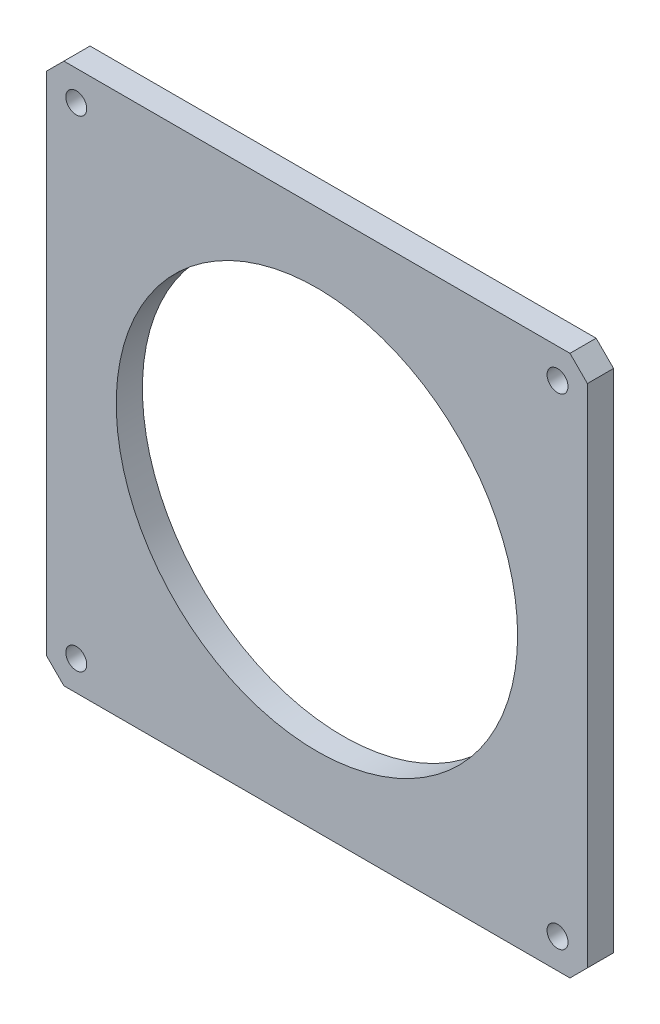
ISO-10303-21;
HEADER;
FILE_DESCRIPTION(('STEP AP214'),'2;1');
FILE_NAME('part.step','',(''),(''),'','','');
FILE_SCHEMA(('AUTOMOTIVE_DESIGN { 1 0 10303 214 1 1 1 1 }'));
ENDSEC;
DATA;
#1=APPLICATION_CONTEXT('core data for automotive mechanical design processes');
#2=APPLICATION_PROTOCOL_DEFINITION('international standard','automotive_design',2000,#1);
#3=PRODUCT_CONTEXT('',#1,'mechanical');
#4=PRODUCT('Part','Part','',(#3));
#5=PRODUCT_RELATED_PRODUCT_CATEGORY('part','',(#4));
#6=PRODUCT_DEFINITION_FORMATION('','',#4);
#7=PRODUCT_DEFINITION_CONTEXT('part definition',#1,'design');
#8=PRODUCT_DEFINITION('design','',#6,#7);
#9=PRODUCT_DEFINITION_SHAPE('','',#8);
#10=(LENGTH_UNIT() NAMED_UNIT(*) SI_UNIT(.MILLI.,.METRE.));
#11=(NAMED_UNIT(*) PLANE_ANGLE_UNIT() SI_UNIT($,.RADIAN.));
#12=(NAMED_UNIT(*) SI_UNIT($,.STERADIAN.) SOLID_ANGLE_UNIT());
#13=UNCERTAINTY_MEASURE_WITH_UNIT(LENGTH_MEASURE(1.E-05),#10,'distance_accuracy_value','');
#14=(GEOMETRIC_REPRESENTATION_CONTEXT(3) GLOBAL_UNCERTAINTY_ASSIGNED_CONTEXT((#13)) GLOBAL_UNIT_ASSIGNED_CONTEXT((#10,
#11,#12)) REPRESENTATION_CONTEXT('',''));
#15=CARTESIAN_POINT('',(0.,0.,0.));
#16=DIRECTION('',(0.,0.,1.));
#17=DIRECTION('',(1.,0.,0.));
#18=AXIS2_PLACEMENT_3D('',#15,#16,#17);
#19=CARTESIAN_POINT('',(0.,0.,30.));
#20=DIRECTION('',(0.,0.,-1.));
#21=DIRECTION('',(-1.,0.,0.));
#22=AXIS2_PLACEMENT_3D('',#19,#20,#21);
#23=PLANE('',#22);
#24=DIRECTION('',(0.,-1.,0.));
#25=VECTOR('',#24,1.);
#26=CARTESIAN_POINT('',(-310.,-290.,30.));
#27=LINE('',#26,#25);
#28=CARTESIAN_POINT('',(-310.,290.,30.));
#29=VERTEX_POINT('',#28);
#30=CARTESIAN_POINT('',(-310.,-290.,30.));
#31=VERTEX_POINT('',#30);
#32=EDGE_CURVE('E145',#29,#31,#27,.T.);
#33=ORIENTED_EDGE('',*,*,#32,.T.);
#34=DIRECTION('',(0.707106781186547,-0.707106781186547,0.));
#35=VECTOR('',#34,1.);
#36=CARTESIAN_POINT('',(-310.,-290.,30.));
#37=LINE('',#36,#35);
#38=CARTESIAN_POINT('',(-290.,-310.,30.));
#39=VERTEX_POINT('',#38);
#40=EDGE_CURVE('E93',#31,#39,#37,.T.);
#41=ORIENTED_EDGE('',*,*,#40,.T.);
#42=DIRECTION('',(1.,0.,0.));
#43=VECTOR('',#42,1.);
#44=CARTESIAN_POINT('',(-290.,-310.,30.));
#45=LINE('',#44,#43);
#46=CARTESIAN_POINT('',(290.,-310.,30.));
#47=VERTEX_POINT('',#46);
#48=EDGE_CURVE('E160',#39,#47,#45,.T.);
#49=ORIENTED_EDGE('',*,*,#48,.T.);
#50=DIRECTION('',(0.707106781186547,0.707106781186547,0.));
#51=VECTOR('',#50,1.);
#52=CARTESIAN_POINT('',(290.,-310.,30.));
#53=LINE('',#52,#51);
#54=CARTESIAN_POINT('',(310.,-290.,30.));
#55=VERTEX_POINT('',#54);
#56=EDGE_CURVE('E173',#47,#55,#53,.T.);
#57=ORIENTED_EDGE('',*,*,#56,.T.);
#58=DIRECTION('',(0.,1.,0.));
#59=VECTOR('',#58,1.);
#60=CARTESIAN_POINT('',(310.,-290.,30.));
#61=LINE('',#60,#59);
#62=CARTESIAN_POINT('',(310.,290.,30.));
#63=VERTEX_POINT('',#62);
#64=EDGE_CURVE('E112',#55,#63,#61,.T.);
#65=ORIENTED_EDGE('',*,*,#64,.T.);
#66=DIRECTION('',(-0.707106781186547,0.707106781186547,0.));
#67=VECTOR('',#66,1.);
#68=CARTESIAN_POINT('',(290.,310.,30.));
#69=LINE('',#68,#67);
#70=CARTESIAN_POINT('',(290.,310.,30.));
#71=VERTEX_POINT('',#70);
#72=EDGE_CURVE('E106',#63,#71,#69,.T.);
#73=ORIENTED_EDGE('',*,*,#72,.T.);
#74=DIRECTION('',(-1.,0.,0.));
#75=VECTOR('',#74,1.);
#76=CARTESIAN_POINT('',(-290.,310.,30.));
#77=LINE('',#76,#75);
#78=CARTESIAN_POINT('',(-290.,310.,30.));
#79=VERTEX_POINT('',#78);
#80=EDGE_CURVE('E110',#71,#79,#77,.T.);
#81=ORIENTED_EDGE('',*,*,#80,.T.);
#82=DIRECTION('',(-0.707106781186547,-0.707106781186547,0.));
#83=VECTOR('',#82,1.);
#84=CARTESIAN_POINT('',(-310.,290.,30.));
#85=LINE('',#84,#83);
#86=EDGE_CURVE('E50',#79,#29,#85,.T.);
#87=ORIENTED_EDGE('',*,*,#86,.T.);
#88=EDGE_LOOP('',(#33,#41,#49,#57,#65,#73,#81,#87));
#89=FACE_BOUND('',#88,.T.);
#90=CARTESIAN_POINT('',(-275.771644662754,275.771644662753,30.));
#91=DIRECTION('',(0.,0.,1.));
#92=DIRECTION('',(1.,0.,0.));
#93=AXIS2_PLACEMENT_3D('',#90,#91,#92);
#94=CIRCLE('',#93,12.);
#95=CARTESIAN_POINT('',(-263.771644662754,275.771644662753,30.));
#96=VERTEX_POINT('',#95);
#97=EDGE_CURVE('E134',#96,#96,#94,.T.);
#98=ORIENTED_EDGE('',*,*,#97,.F.);
#99=EDGE_LOOP('',(#98));
#100=FACE_BOUND('',#99,.T.);
#101=CARTESIAN_POINT('',(275.771644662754,275.771644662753,30.));
#102=DIRECTION('',(0.,0.,1.));
#103=DIRECTION('',(1.,0.,0.));
#104=AXIS2_PLACEMENT_3D('',#101,#102,#103);
#105=CIRCLE('',#104,12.);
#106=CARTESIAN_POINT('',(287.771644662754,275.771644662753,30.));
#107=VERTEX_POINT('',#106);
#108=EDGE_CURVE('E182',#107,#107,#105,.T.);
#109=ORIENTED_EDGE('',*,*,#108,.F.);
#110=EDGE_LOOP('',(#109));
#111=FACE_BOUND('',#110,.T.);
#112=CARTESIAN_POINT('',(-275.771644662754,-275.771644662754,30.));
#113=DIRECTION('',(0.,0.,1.));
#114=DIRECTION('',(1.,0.,0.));
#115=AXIS2_PLACEMENT_3D('',#112,#113,#114);
#116=CIRCLE('',#115,12.);
#117=CARTESIAN_POINT('',(-263.771644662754,-275.771644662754,30.));
#118=VERTEX_POINT('',#117);
#119=EDGE_CURVE('E188',#118,#118,#116,.T.);
#120=ORIENTED_EDGE('',*,*,#119,.F.);
#121=EDGE_LOOP('',(#120));
#122=FACE_BOUND('',#121,.T.);
#123=CARTESIAN_POINT('',(275.771644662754,-275.771644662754,30.));
#124=DIRECTION('',(0.,0.,1.));
#125=DIRECTION('',(1.,0.,0.));
#126=AXIS2_PLACEMENT_3D('',#123,#124,#125);
#127=CIRCLE('',#126,12.);
#128=CARTESIAN_POINT('',(287.771644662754,-275.771644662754,30.));
#129=VERTEX_POINT('',#128);
#130=EDGE_CURVE('E194',#129,#129,#127,.T.);
#131=ORIENTED_EDGE('',*,*,#130,.F.);
#132=EDGE_LOOP('',(#131));
#133=FACE_BOUND('',#132,.T.);
#134=CARTESIAN_POINT('',(0.,0.,30.));
#135=DIRECTION('',(0.,0.,1.));
#136=DIRECTION('',(1.,0.,0.));
#137=AXIS2_PLACEMENT_3D('',#134,#135,#136);
#138=CIRCLE('',#137,230.);
#139=CARTESIAN_POINT('',(230.,0.,30.));
#140=VERTEX_POINT('',#139);
#141=EDGE_CURVE('E200',#140,#140,#138,.T.);
#142=ORIENTED_EDGE('',*,*,#141,.F.);
#143=EDGE_LOOP('',(#142));
#144=FACE_BOUND('',#143,.T.);
#145=ADVANCED_FACE('F33',(#89,#100,#111,#122,#133,#144),#23,.F.);
#146=CARTESIAN_POINT('',(0.,0.,0.));
#147=DIRECTION('',(0.,0.,-1.));
#148=DIRECTION('',(-1.,0.,0.));
#149=AXIS2_PLACEMENT_3D('',#146,#147,#148);
#150=PLANE('',#149);
#151=CARTESIAN_POINT('',(275.771644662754,-275.771644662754,0.));
#152=DIRECTION('',(0.,0.,1.));
#153=DIRECTION('',(1.,0.,0.));
#154=AXIS2_PLACEMENT_3D('',#151,#152,#153);
#155=CIRCLE('',#154,12.);
#156=CARTESIAN_POINT('',(287.771644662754,-275.771644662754,0.));
#157=VERTEX_POINT('',#156);
#158=EDGE_CURVE('E197',#157,#157,#155,.T.);
#159=ORIENTED_EDGE('',*,*,#158,.T.);
#160=EDGE_LOOP('',(#159));
#161=FACE_BOUND('',#160,.T.);
#162=CARTESIAN_POINT('',(275.771644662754,275.771644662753,0.));
#163=DIRECTION('',(0.,0.,1.));
#164=DIRECTION('',(1.,0.,0.));
#165=AXIS2_PLACEMENT_3D('',#162,#163,#164);
#166=CIRCLE('',#165,12.);
#167=CARTESIAN_POINT('',(287.771644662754,275.771644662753,0.));
#168=VERTEX_POINT('',#167);
#169=EDGE_CURVE('E185',#168,#168,#166,.T.);
#170=ORIENTED_EDGE('',*,*,#169,.T.);
#171=EDGE_LOOP('',(#170));
#172=FACE_BOUND('',#171,.T.);
#173=DIRECTION('',(0.,-1.,0.));
#174=VECTOR('',#173,1.);
#175=CARTESIAN_POINT('',(-310.,-290.,0.));
#176=LINE('',#175,#174);
#177=CARTESIAN_POINT('',(-310.,290.,0.));
#178=VERTEX_POINT('',#177);
#179=CARTESIAN_POINT('',(-310.,-290.,0.));
#180=VERTEX_POINT('',#179);
#181=EDGE_CURVE('E130',#178,#180,#176,.T.);
#182=ORIENTED_EDGE('',*,*,#181,.F.);
#183=DIRECTION('',(-0.707106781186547,-0.707106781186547,0.));
#184=VECTOR('',#183,1.);
#185=CARTESIAN_POINT('',(-310.,290.,0.));
#186=LINE('',#185,#184);
#187=CARTESIAN_POINT('',(-290.,310.,0.));
#188=VERTEX_POINT('',#187);
#189=EDGE_CURVE('E85',#188,#178,#186,.T.);
#190=ORIENTED_EDGE('',*,*,#189,.F.);
#191=DIRECTION('',(-1.,0.,0.));
#192=VECTOR('',#191,1.);
#193=CARTESIAN_POINT('',(-290.,310.,0.));
#194=LINE('',#193,#192);
#195=CARTESIAN_POINT('',(290.,310.,0.));
#196=VERTEX_POINT('',#195);
#197=EDGE_CURVE('E79',#196,#188,#194,.T.);
#198=ORIENTED_EDGE('',*,*,#197,.F.);
#199=DIRECTION('',(-0.707106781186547,0.707106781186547,0.));
#200=VECTOR('',#199,1.);
#201=CARTESIAN_POINT('',(290.,310.,0.));
#202=LINE('',#201,#200);
#203=CARTESIAN_POINT('',(310.,290.,0.));
#204=VERTEX_POINT('',#203);
#205=EDGE_CURVE('E120',#204,#196,#202,.T.);
#206=ORIENTED_EDGE('',*,*,#205,.F.);
#207=DIRECTION('',(0.,1.,0.));
#208=VECTOR('',#207,1.);
#209=CARTESIAN_POINT('',(310.,-290.,0.));
#210=LINE('',#209,#208);
#211=CARTESIAN_POINT('',(310.,-290.,0.));
#212=VERTEX_POINT('',#211);
#213=EDGE_CURVE('E140',#212,#204,#210,.T.);
#214=ORIENTED_EDGE('',*,*,#213,.F.);
#215=DIRECTION('',(0.707106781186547,0.707106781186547,0.));
#216=VECTOR('',#215,1.);
#217=CARTESIAN_POINT('',(290.,-310.,0.));
#218=LINE('',#217,#216);
#219=CARTESIAN_POINT('',(290.,-310.,0.));
#220=VERTEX_POINT('',#219);
#221=EDGE_CURVE('E138',#220,#212,#218,.T.);
#222=ORIENTED_EDGE('',*,*,#221,.F.);
#223=DIRECTION('',(1.,0.,0.));
#224=VECTOR('',#223,1.);
#225=CARTESIAN_POINT('',(-290.,-310.,0.));
#226=LINE('',#225,#224);
#227=CARTESIAN_POINT('',(-290.,-310.,0.));
#228=VERTEX_POINT('',#227);
#229=EDGE_CURVE('E136',#228,#220,#226,.T.);
#230=ORIENTED_EDGE('',*,*,#229,.F.);
#231=DIRECTION('',(0.707106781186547,-0.707106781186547,0.));
#232=VECTOR('',#231,1.);
#233=CARTESIAN_POINT('',(-310.,-290.,0.));
#234=LINE('',#233,#232);
#235=EDGE_CURVE('E133',#180,#228,#234,.T.);
#236=ORIENTED_EDGE('',*,*,#235,.F.);
#237=EDGE_LOOP('',(#182,#190,#198,#206,#214,#222,#230,#236));
#238=FACE_BOUND('',#237,.T.);
#239=CARTESIAN_POINT('',(-275.771644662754,275.771644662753,0.));
#240=DIRECTION('',(0.,0.,1.));
#241=DIRECTION('',(1.,0.,0.));
#242=AXIS2_PLACEMENT_3D('',#239,#240,#241);
#243=CIRCLE('',#242,12.);
#244=CARTESIAN_POINT('',(-263.771644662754,275.771644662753,0.));
#245=VERTEX_POINT('',#244);
#246=EDGE_CURVE('E179',#245,#245,#243,.T.);
#247=ORIENTED_EDGE('',*,*,#246,.T.);
#248=EDGE_LOOP('',(#247));
#249=FACE_BOUND('',#248,.T.);
#250=CARTESIAN_POINT('',(-275.771644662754,-275.771644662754,0.));
#251=DIRECTION('',(0.,0.,1.));
#252=DIRECTION('',(1.,0.,0.));
#253=AXIS2_PLACEMENT_3D('',#250,#251,#252);
#254=CIRCLE('',#253,12.);
#255=CARTESIAN_POINT('',(-263.771644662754,-275.771644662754,0.));
#256=VERTEX_POINT('',#255);
#257=EDGE_CURVE('E191',#256,#256,#254,.T.);
#258=ORIENTED_EDGE('',*,*,#257,.T.);
#259=EDGE_LOOP('',(#258));
#260=FACE_BOUND('',#259,.T.);
#261=CARTESIAN_POINT('',(0.,0.,0.));
#262=DIRECTION('',(0.,0.,1.));
#263=DIRECTION('',(1.,0.,0.));
#264=AXIS2_PLACEMENT_3D('',#261,#262,#263);
#265=CIRCLE('',#264,230.);
#266=CARTESIAN_POINT('',(230.,0.,0.));
#267=VERTEX_POINT('',#266);
#268=EDGE_CURVE('E203',#267,#267,#265,.T.);
#269=ORIENTED_EDGE('',*,*,#268,.T.);
#270=EDGE_LOOP('',(#269));
#271=FACE_BOUND('',#270,.T.);
#272=ADVANCED_FACE('F164',(#161,#172,#238,#249,#260,#271),#150,.T.);
#273=CARTESIAN_POINT('',(-310.,-290.,30.));
#274=DIRECTION('',(1.,0.,0.));
#275=DIRECTION('',(0.,0.,-1.));
#276=AXIS2_PLACEMENT_3D('',#273,#274,#275);
#277=PLANE('',#276);
#278=ORIENTED_EDGE('',*,*,#181,.T.);
#279=DIRECTION('',(0.,0.,-1.));
#280=VECTOR('',#279,1.);
#281=CARTESIAN_POINT('',(-310.,-290.,30.));
#282=LINE('',#281,#280);
#283=EDGE_CURVE('E11',#31,#180,#282,.T.);
#284=ORIENTED_EDGE('',*,*,#283,.F.);
#285=ORIENTED_EDGE('',*,*,#32,.F.);
#286=DIRECTION('',(0.,0.,-1.));
#287=VECTOR('',#286,1.);
#288=CARTESIAN_POINT('',(-310.,290.,30.));
#289=LINE('',#288,#287);
#290=EDGE_CURVE('E126',#29,#178,#289,.T.);
#291=ORIENTED_EDGE('',*,*,#290,.T.);
#292=EDGE_LOOP('',(#278,#284,#285,#291));
#293=FACE_BOUND('',#292,.T.);
#294=ADVANCED_FACE('F35',(#293),#277,.F.);
#295=CARTESIAN_POINT('',(-310.,-290.,30.));
#296=DIRECTION('',(0.707106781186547,0.707106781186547,0.));
#297=DIRECTION('',(-0.707106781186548,0.707106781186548,0.));
#298=AXIS2_PLACEMENT_3D('',#295,#296,#297);
#299=PLANE('',#298);
#300=ORIENTED_EDGE('',*,*,#235,.T.);
#301=DIRECTION('',(0.,0.,-1.));
#302=VECTOR('',#301,1.);
#303=CARTESIAN_POINT('',(-290.,-310.,30.));
#304=LINE('',#303,#302);
#305=EDGE_CURVE('E42',#39,#228,#304,.T.);
#306=ORIENTED_EDGE('',*,*,#305,.F.);
#307=ORIENTED_EDGE('',*,*,#40,.F.);
#308=ORIENTED_EDGE('',*,*,#283,.T.);
#309=EDGE_LOOP('',(#300,#306,#307,#308));
#310=FACE_BOUND('',#309,.T.);
#311=ADVANCED_FACE('F235',(#310),#299,.F.);
#312=CARTESIAN_POINT('',(-290.,-310.,30.));
#313=DIRECTION('',(0.,1.,0.));
#314=DIRECTION('',(0.,0.,1.));
#315=AXIS2_PLACEMENT_3D('',#312,#313,#314);
#316=PLANE('',#315);
#317=ORIENTED_EDGE('',*,*,#229,.T.);
#318=DIRECTION('',(0.,0.,-1.));
#319=VECTOR('',#318,1.);
#320=CARTESIAN_POINT('',(290.,-310.,30.));
#321=LINE('',#320,#319);
#322=EDGE_CURVE('E152',#47,#220,#321,.T.);
#323=ORIENTED_EDGE('',*,*,#322,.F.);
#324=ORIENTED_EDGE('',*,*,#48,.F.);
#325=ORIENTED_EDGE('',*,*,#305,.T.);
#326=EDGE_LOOP('',(#317,#323,#324,#325));
#327=FACE_BOUND('',#326,.T.);
#328=ADVANCED_FACE('F158',(#327),#316,.F.);
#329=CARTESIAN_POINT('',(290.,-310.,30.));
#330=DIRECTION('',(-0.707106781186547,0.707106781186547,0.));
#331=DIRECTION('',(-0.707106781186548,-0.707106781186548,0.));
#332=AXIS2_PLACEMENT_3D('',#329,#330,#331);
#333=PLANE('',#332);
#334=ORIENTED_EDGE('',*,*,#221,.T.);
#335=DIRECTION('',(0.,0.,-1.));
#336=VECTOR('',#335,1.);
#337=CARTESIAN_POINT('',(310.,-290.,30.));
#338=LINE('',#337,#336);
#339=EDGE_CURVE('E149',#55,#212,#338,.T.);
#340=ORIENTED_EDGE('',*,*,#339,.F.);
#341=ORIENTED_EDGE('',*,*,#56,.F.);
#342=ORIENTED_EDGE('',*,*,#322,.T.);
#343=EDGE_LOOP('',(#334,#340,#341,#342));
#344=FACE_BOUND('',#343,.T.);
#345=ADVANCED_FACE('F169',(#344),#333,.F.);
#346=CARTESIAN_POINT('',(310.,-290.,30.));
#347=DIRECTION('',(-1.,0.,0.));
#348=DIRECTION('',(0.,0.,1.));
#349=AXIS2_PLACEMENT_3D('',#346,#347,#348);
#350=PLANE('',#349);
#351=ORIENTED_EDGE('',*,*,#213,.T.);
#352=DIRECTION('',(0.,0.,-1.));
#353=VECTOR('',#352,1.);
#354=CARTESIAN_POINT('',(310.,290.,30.));
#355=LINE('',#354,#353);
#356=EDGE_CURVE('E121',#63,#204,#355,.T.);
#357=ORIENTED_EDGE('',*,*,#356,.F.);
#358=ORIENTED_EDGE('',*,*,#64,.F.);
#359=ORIENTED_EDGE('',*,*,#339,.T.);
#360=EDGE_LOOP('',(#351,#357,#358,#359));
#361=FACE_BOUND('',#360,.T.);
#362=ADVANCED_FACE('F172',(#361),#350,.F.);
#363=CARTESIAN_POINT('',(290.,310.,30.));
#364=DIRECTION('',(-0.707106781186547,-0.707106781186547,0.));
#365=DIRECTION('',(0.707106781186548,-0.707106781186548,0.));
#366=AXIS2_PLACEMENT_3D('',#363,#364,#365);
#367=PLANE('',#366);
#368=ORIENTED_EDGE('',*,*,#205,.T.);
#369=DIRECTION('',(0.,0.,-1.));
#370=VECTOR('',#369,1.);
#371=CARTESIAN_POINT('',(290.,310.,30.));
#372=LINE('',#371,#370);
#373=EDGE_CURVE('E117',#71,#196,#372,.T.);
#374=ORIENTED_EDGE('',*,*,#373,.F.);
#375=ORIENTED_EDGE('',*,*,#72,.F.);
#376=ORIENTED_EDGE('',*,*,#356,.T.);
#377=EDGE_LOOP('',(#368,#374,#375,#376));
#378=FACE_BOUND('',#377,.T.);
#379=ADVANCED_FACE('F118',(#378),#367,.F.);
#380=CARTESIAN_POINT('',(-290.,310.,30.));
#381=DIRECTION('',(0.,-1.,0.));
#382=DIRECTION('',(0.,0.,-1.));
#383=AXIS2_PLACEMENT_3D('',#380,#381,#382);
#384=PLANE('',#383);
#385=ORIENTED_EDGE('',*,*,#197,.T.);
#386=DIRECTION('',(0.,0.,-1.));
#387=VECTOR('',#386,1.);
#388=CARTESIAN_POINT('',(-290.,310.,30.));
#389=LINE('',#388,#387);
#390=EDGE_CURVE('E122',#79,#188,#389,.T.);
#391=ORIENTED_EDGE('',*,*,#390,.F.);
#392=ORIENTED_EDGE('',*,*,#80,.F.);
#393=ORIENTED_EDGE('',*,*,#373,.T.);
#394=EDGE_LOOP('',(#385,#391,#392,#393));
#395=FACE_BOUND('',#394,.T.);
#396=ADVANCED_FACE('F124',(#395),#384,.F.);
#397=CARTESIAN_POINT('',(-310.,290.,30.));
#398=DIRECTION('',(0.707106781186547,-0.707106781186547,0.));
#399=DIRECTION('',(0.707106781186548,0.707106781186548,0.));
#400=AXIS2_PLACEMENT_3D('',#397,#398,#399);
#401=PLANE('',#400);
#402=ORIENTED_EDGE('',*,*,#189,.T.);
#403=ORIENTED_EDGE('',*,*,#290,.F.);
#404=ORIENTED_EDGE('',*,*,#86,.F.);
#405=ORIENTED_EDGE('',*,*,#390,.T.);
#406=EDGE_LOOP('',(#402,#403,#404,#405));
#407=FACE_BOUND('',#406,.T.);
#408=ADVANCED_FACE('F223',(#407),#401,.F.);
#409=CARTESIAN_POINT('',(-275.771644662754,275.771644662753,30.));
#410=DIRECTION('',(0.,0.,-1.));
#411=DIRECTION('',(-1.,0.,0.));
#412=AXIS2_PLACEMENT_3D('',#409,#410,#411);
#413=CYLINDRICAL_SURFACE('',#412,12.);
#414=ORIENTED_EDGE('',*,*,#97,.T.);
#415=EDGE_LOOP('',(#414));
#416=FACE_BOUND('',#415,.T.);
#417=ORIENTED_EDGE('',*,*,#246,.F.);
#418=EDGE_LOOP('',(#417));
#419=FACE_BOUND('',#418,.T.);
#420=ADVANCED_FACE('F220',(#416,#419),#413,.F.);
#421=CARTESIAN_POINT('',(275.771644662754,275.771644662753,30.));
#422=DIRECTION('',(0.,0.,-1.));
#423=DIRECTION('',(-1.,0.,0.));
#424=AXIS2_PLACEMENT_3D('',#421,#422,#423);
#425=CYLINDRICAL_SURFACE('',#424,12.);
#426=ORIENTED_EDGE('',*,*,#108,.T.);
#427=EDGE_LOOP('',(#426));
#428=FACE_BOUND('',#427,.T.);
#429=ORIENTED_EDGE('',*,*,#169,.F.);
#430=EDGE_LOOP('',(#429));
#431=FACE_BOUND('',#430,.T.);
#432=ADVANCED_FACE('F299',(#428,#431),#425,.F.);
#433=CARTESIAN_POINT('',(-275.771644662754,-275.771644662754,30.));
#434=DIRECTION('',(0.,0.,-1.));
#435=DIRECTION('',(-1.,0.,0.));
#436=AXIS2_PLACEMENT_3D('',#433,#434,#435);
#437=CYLINDRICAL_SURFACE('',#436,12.);
#438=ORIENTED_EDGE('',*,*,#119,.T.);
#439=EDGE_LOOP('',(#438));
#440=FACE_BOUND('',#439,.T.);
#441=ORIENTED_EDGE('',*,*,#257,.F.);
#442=EDGE_LOOP('',(#441));
#443=FACE_BOUND('',#442,.T.);
#444=ADVANCED_FACE('F307',(#440,#443),#437,.F.);
#445=CARTESIAN_POINT('',(275.771644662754,-275.771644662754,30.));
#446=DIRECTION('',(0.,0.,-1.));
#447=DIRECTION('',(-1.,0.,0.));
#448=AXIS2_PLACEMENT_3D('',#445,#446,#447);
#449=CYLINDRICAL_SURFACE('',#448,12.);
#450=ORIENTED_EDGE('',*,*,#130,.T.);
#451=EDGE_LOOP('',(#450));
#452=FACE_BOUND('',#451,.T.);
#453=ORIENTED_EDGE('',*,*,#158,.F.);
#454=EDGE_LOOP('',(#453));
#455=FACE_BOUND('',#454,.T.);
#456=ADVANCED_FACE('F315',(#452,#455),#449,.F.);
#457=CARTESIAN_POINT('',(0.,0.,30.));
#458=DIRECTION('',(0.,0.,-1.));
#459=DIRECTION('',(-1.,0.,0.));
#460=AXIS2_PLACEMENT_3D('',#457,#458,#459);
#461=CYLINDRICAL_SURFACE('',#460,230.);
#462=ORIENTED_EDGE('',*,*,#141,.T.);
#463=EDGE_LOOP('',(#462));
#464=FACE_BOUND('',#463,.T.);
#465=ORIENTED_EDGE('',*,*,#268,.F.);
#466=EDGE_LOOP('',(#465));
#467=FACE_BOUND('',#466,.T.);
#468=ADVANCED_FACE('F209',(#464,#467),#461,.F.);
#469=CLOSED_SHELL('',(#145,#272,#294,#311,#328,#345,#362,#379,#396,#408,#420,#432,#444,#456,#468));
#470=MANIFOLD_SOLID_BREP('B2',#469);
#471=ADVANCED_BREP_SHAPE_REPRESENTATION('',(#18,#470),#14);
#472=SHAPE_DEFINITION_REPRESENTATION(#9,#471);
ENDSEC;
END-ISO-10303-21;
